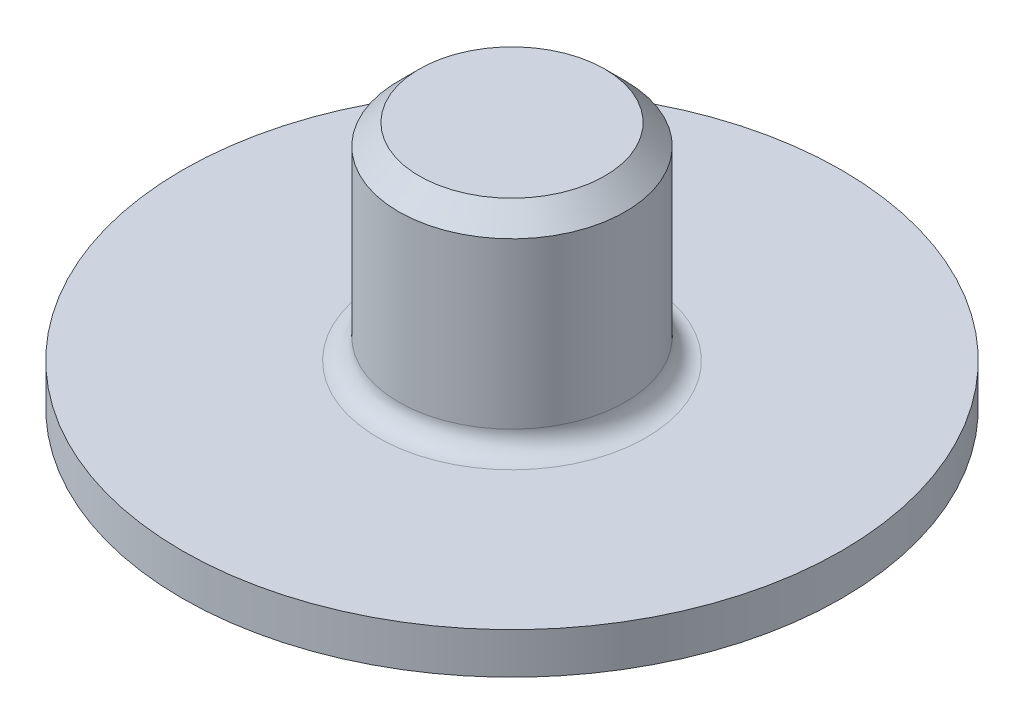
from build123d import *

# Parameters (mm, degrees)
CHANFREIN1_SIZE = 1
CONG_1_R        = 1


with BuildPart() as part:
    # Esquisse1 → R_volution1 (revolve)
    with BuildSketch(Plane.XY, mode=Mode.PRIVATE) as r_volution1_sk:
        Polygon((0, 0), (-16, 0), (-16, 2), (-5.5, 2), (-5.5, 12), (0, 12), align=None)
    revolve(r_volution1_sk.sketch.rotate(Axis((0, 0, 0), (0, 1, 0)), 270), axis=Axis((0, 0, 0), (0, 1, 0)))

    # Chanfrein1
    chanfrein1_edges = [part.edges().sort_by_distance(p)[0] for p in [
        (0, 12, 5.5),
    ]]
    chamfer(chanfrein1_edges, length=CHANFREIN1_SIZE)

    # Cong_1
    cong_1_edges = [part.edges().sort_by_distance(p)[0] for p in [
        (0, 2, 5.5),
    ]]
    fillet(cong_1_edges, radius=CONG_1_R)


solid = part.part
